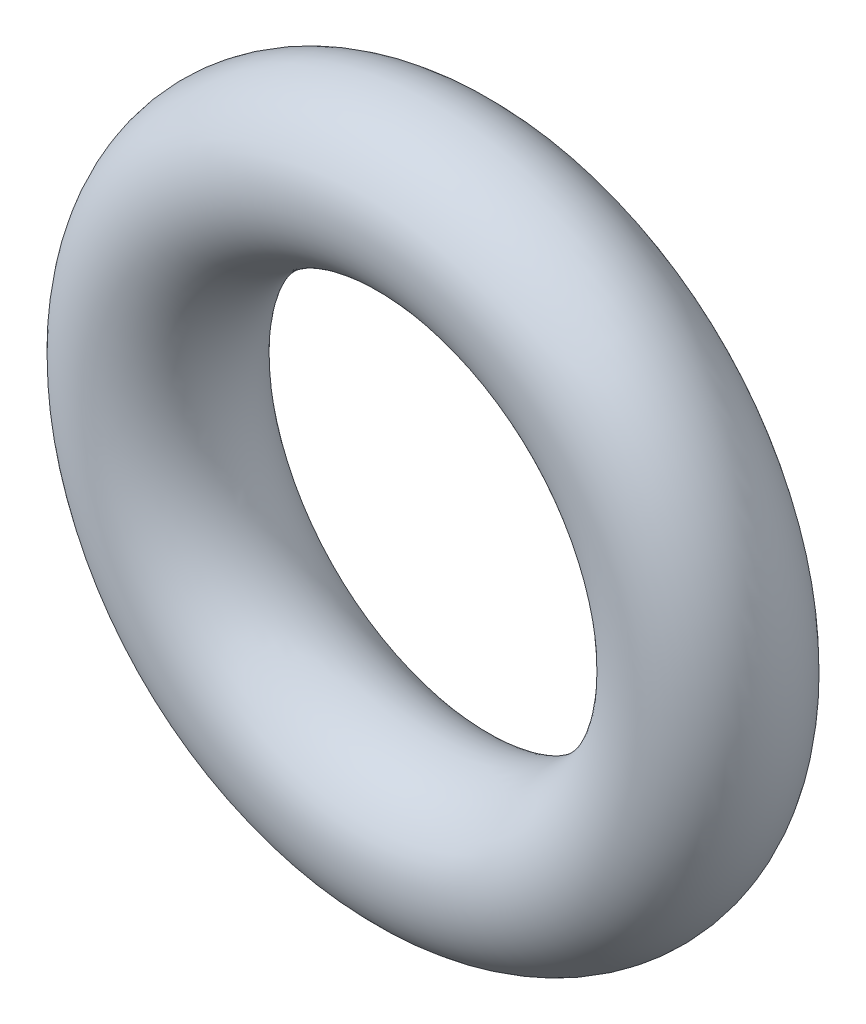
ISO-10303-21;
HEADER;
FILE_DESCRIPTION(('STEP AP214'),'2;1');
FILE_NAME('part.step','',(''),(''),'','','');
FILE_SCHEMA(('AUTOMOTIVE_DESIGN { 1 0 10303 214 1 1 1 1 }'));
ENDSEC;
DATA;
#1=APPLICATION_CONTEXT('core data for automotive mechanical design processes');
#2=APPLICATION_PROTOCOL_DEFINITION('international standard','automotive_design',2000,#1);
#3=PRODUCT_CONTEXT('',#1,'mechanical');
#4=PRODUCT('Part','Part','',(#3));
#5=PRODUCT_RELATED_PRODUCT_CATEGORY('part','',(#4));
#6=PRODUCT_DEFINITION_FORMATION('','',#4);
#7=PRODUCT_DEFINITION_CONTEXT('part definition',#1,'design');
#8=PRODUCT_DEFINITION('design','',#6,#7);
#9=PRODUCT_DEFINITION_SHAPE('','',#8);
#10=(LENGTH_UNIT() NAMED_UNIT(*) SI_UNIT(.MILLI.,.METRE.));
#11=(NAMED_UNIT(*) PLANE_ANGLE_UNIT() SI_UNIT($,.RADIAN.));
#12=(NAMED_UNIT(*) SI_UNIT($,.STERADIAN.) SOLID_ANGLE_UNIT());
#13=UNCERTAINTY_MEASURE_WITH_UNIT(LENGTH_MEASURE(1.E-05),#10,'distance_accuracy_value','');
#14=(GEOMETRIC_REPRESENTATION_CONTEXT(3) GLOBAL_UNCERTAINTY_ASSIGNED_CONTEXT((#13)) GLOBAL_UNIT_ASSIGNED_CONTEXT((#10,
#11,#12)) REPRESENTATION_CONTEXT('',''));
#15=CARTESIAN_POINT('',(0.,0.,0.));
#16=DIRECTION('',(0.,0.,1.));
#17=DIRECTION('',(1.,0.,0.));
#18=AXIS2_PLACEMENT_3D('',#15,#16,#17);
#19=CARTESIAN_POINT('',(0.,0.,0.));
#20=DIRECTION('',(0.,0.,1.));
#21=DIRECTION('',(1.,0.,0.));
#22=AXIS2_PLACEMENT_3D('',#19,#20,#21);
#23=TOROIDAL_SURFACE('',#22,1.75,0.5);
#24=CARTESIAN_POINT('',(2.25,0.,0.));
#25=VERTEX_POINT('',#24);
#26=VERTEX_LOOP('',#25);
#27=FACE_BOUND('',#26,.T.);
#28=ADVANCED_FACE('F30',(#27),#23,.T.);
#29=CLOSED_SHELL('',(#28));
#30=MANIFOLD_SOLID_BREP('B2',#29);
#31=ADVANCED_BREP_SHAPE_REPRESENTATION('',(#18,#30),#14);
#32=SHAPE_DEFINITION_REPRESENTATION(#9,#31);
ENDSEC;
END-ISO-10303-21;
